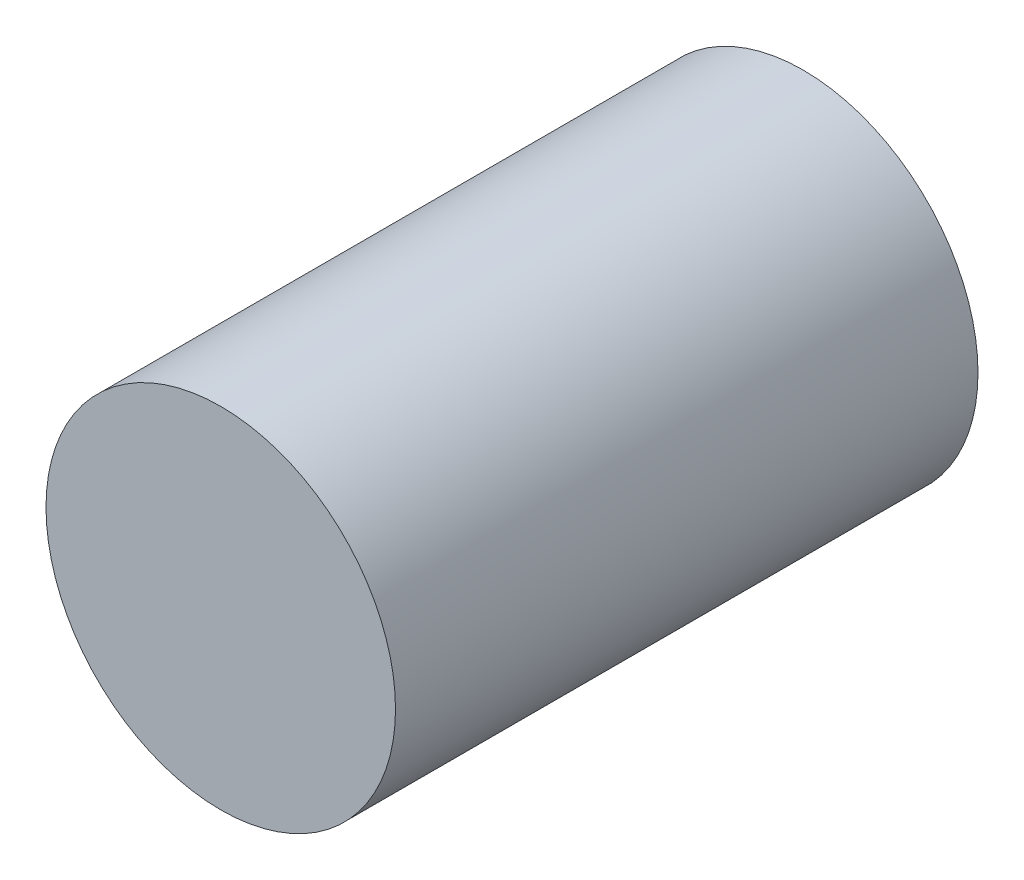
from build123d import *

# Parameters (mm, degrees)
SKETCH1_R           = 30
BOSS_EXTRUDE1_DEPTH = 100


with BuildPart() as part:
    # Sketch1 → Boss-Extrude1 (new body)
    with BuildSketch(Plane.XY):
        Circle(SKETCH1_R)
    extrude(amount=-BOSS_EXTRUDE1_DEPTH)


solid = part.part
